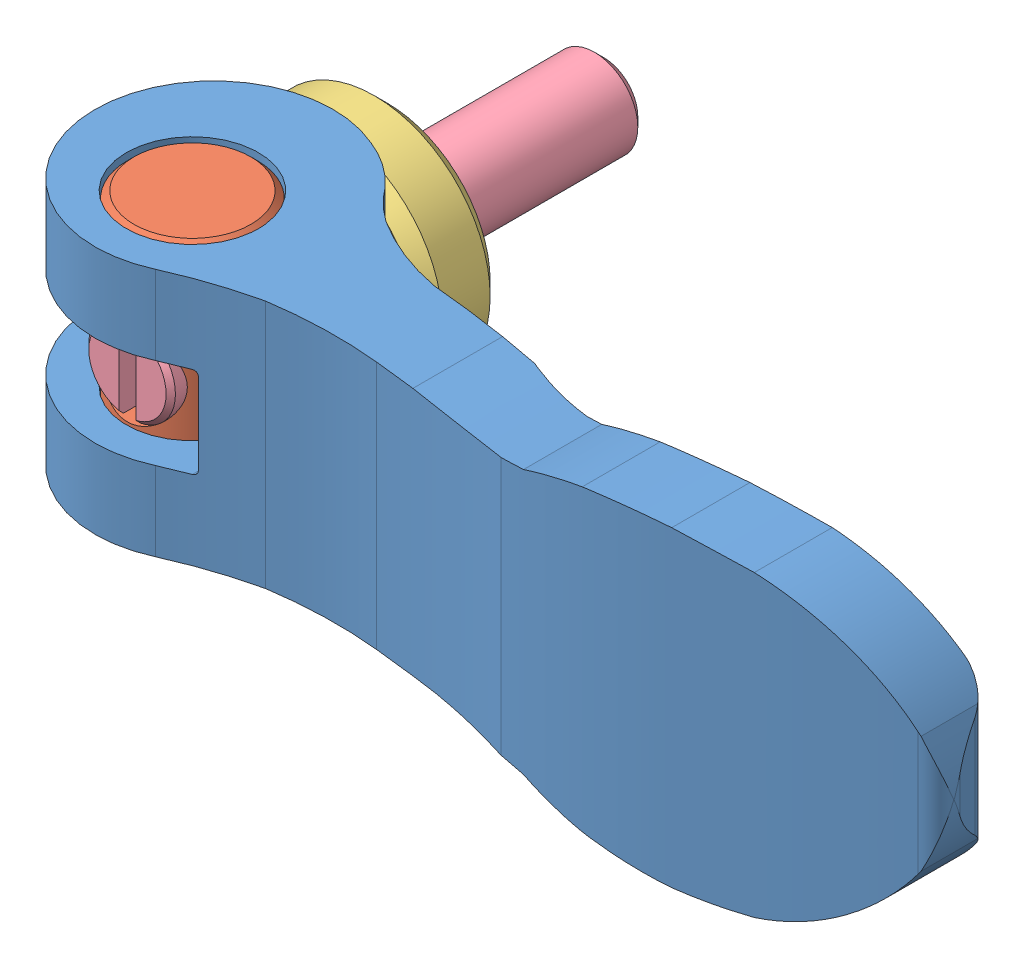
SolidWorks assembly KCL04AX10-SUS.SLDASM, configuration Default (file format 15000). Lengths in mm.
Overall size (41.7 14.48 23.5).
4 component instances, 4 part files, 0 mates.
Components (placement in the parent):
- KCL04AX10-SUS_01-1: KCL04AX10-SUS_01.SLDPRT [ﾃﾞﾌｫﾙﾄ] at (0 0 9) x (1 0 0) z (0 -1 0) size (41.7 11 14.48)
- KCL04AX10-SUS_02-1: KCL04AX10-SUS_02.SLDPRT [ﾃﾞﾌｫﾙﾄ] at (0 0 9) x (0 1 0) z (1 0 0) size (11.5 6 6)
- KCL04AX10-SUS_03-1: KCL04AX10-SUS_03.SLDPRT [ﾃﾞﾌｫﾙﾄ] x (1 0 0) z (0 -1 0) size (10.7 3.73 10.7)
- KCL04AX10-SUS_04-1: KCL04AX10-SUS_04.SLDPRT [ﾃﾞﾌｫﾙﾄ] at (0 0 -10) x (0 1 0) z (1 0 0) size (4 22 4)
